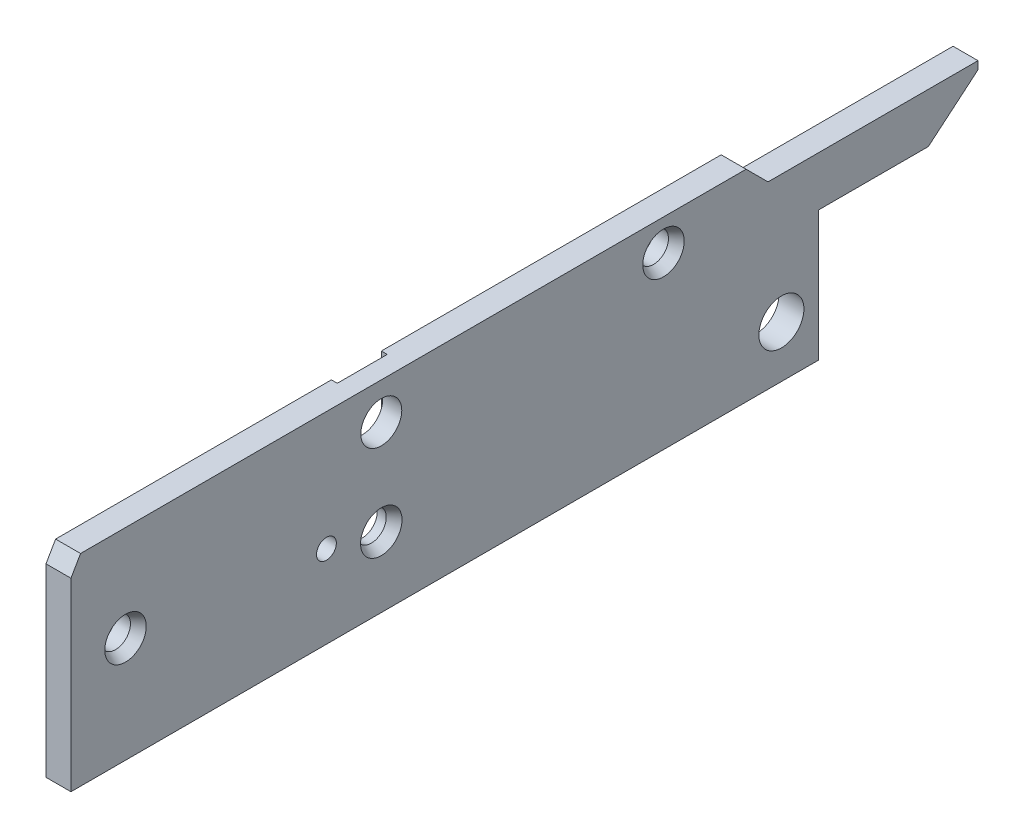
ISO-10303-21;
HEADER;
FILE_DESCRIPTION(('STEP AP214'),'2;1');
FILE_NAME('part.step','',(''),(''),'','','');
FILE_SCHEMA(('AUTOMOTIVE_DESIGN { 1 0 10303 214 1 1 1 1 }'));
ENDSEC;
DATA;
#1=APPLICATION_CONTEXT('core data for automotive mechanical design processes');
#2=APPLICATION_PROTOCOL_DEFINITION('international standard','automotive_design',2000,#1);
#3=PRODUCT_CONTEXT('',#1,'mechanical');
#4=PRODUCT('Part','Part','',(#3));
#5=PRODUCT_RELATED_PRODUCT_CATEGORY('part','',(#4));
#6=PRODUCT_DEFINITION_FORMATION('','',#4);
#7=PRODUCT_DEFINITION_CONTEXT('part definition',#1,'design');
#8=PRODUCT_DEFINITION('design','',#6,#7);
#9=PRODUCT_DEFINITION_SHAPE('','',#8);
#10=(LENGTH_UNIT() NAMED_UNIT(*) SI_UNIT(.MILLI.,.METRE.));
#11=(NAMED_UNIT(*) PLANE_ANGLE_UNIT() SI_UNIT($,.RADIAN.));
#12=(NAMED_UNIT(*) SI_UNIT($,.STERADIAN.) SOLID_ANGLE_UNIT());
#13=UNCERTAINTY_MEASURE_WITH_UNIT(LENGTH_MEASURE(1.E-05),#10,'distance_accuracy_value','');
#14=(GEOMETRIC_REPRESENTATION_CONTEXT(3) GLOBAL_UNCERTAINTY_ASSIGNED_CONTEXT((#13)) GLOBAL_UNIT_ASSIGNED_CONTEXT((#10,
#11,#12)) REPRESENTATION_CONTEXT('',''));
#15=CARTESIAN_POINT('',(0.,0.,0.));
#16=DIRECTION('',(0.,0.,1.));
#17=DIRECTION('',(1.,0.,0.));
#18=AXIS2_PLACEMENT_3D('',#15,#16,#17);
#19=CARTESIAN_POINT('',(0.,0.,0.));
#20=DIRECTION('',(-1.,0.,0.));
#21=DIRECTION('',(0.,0.,1.));
#22=AXIS2_PLACEMENT_3D('',#19,#20,#21);
#23=PLANE('',#22);
#24=CARTESIAN_POINT('',(0.,4.9276,72.2376));
#25=DIRECTION('',(-1.,0.,0.));
#26=DIRECTION('',(0.,0.,1.));
#27=AXIS2_PLACEMENT_3D('',#24,#25,#26);
#28=CIRCLE('',#27,2.2622076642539);
#29=CARTESIAN_POINT('',(0.,4.9276,74.4998076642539));
#30=VERTEX_POINT('',#29);
#31=EDGE_CURVE('E115',#30,#30,#28,.F.);
#32=ORIENTED_EDGE('',*,*,#31,.T.);
#33=EDGE_LOOP('',(#32));
#34=FACE_BOUND('',#33,.T.);
#35=CARTESIAN_POINT('',(0.,8.5852,104.14));
#36=DIRECTION('',(1.,0.,0.));
#37=DIRECTION('',(0.,0.,-1.));
#38=AXIS2_PLACEMENT_3D('',#35,#36,#37);
#39=CIRCLE('',#38,2.3749);
#40=CARTESIAN_POINT('',(0.,8.5852,101.7651));
#41=VERTEX_POINT('',#40);
#42=EDGE_CURVE('E379',#41,#41,#39,.T.);
#43=ORIENTED_EDGE('',*,*,#42,.T.);
#44=EDGE_LOOP('',(#43));
#45=FACE_BOUND('',#44,.T.);
#46=DIRECTION('',(0.,0.,1.));
#47=VECTOR('',#46,1.);
#48=CARTESIAN_POINT('',(0.,23.7998,5.60069999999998));
#49=LINE('',#48,#47);
#50=CARTESIAN_POINT('',(0.,23.7998,67.4878));
#51=VERTEX_POINT('',#50);
#52=CARTESIAN_POINT('',(0.,23.7998,111.2774));
#53=VERTEX_POINT('',#52);
#54=EDGE_CURVE('E243',#51,#53,#49,.T.);
#55=ORIENTED_EDGE('',*,*,#54,.F.);
#56=DIRECTION('',(0.,-1.,0.));
#57=VECTOR('',#56,1.);
#58=CARTESIAN_POINT('',(0.,23.7998,67.4878));
#59=LINE('',#58,#57);
#60=CARTESIAN_POINT('',(0.,-8.2042,67.4878));
#61=VERTEX_POINT('',#60);
#62=EDGE_CURVE('E458',#51,#61,#59,.T.);
#63=ORIENTED_EDGE('',*,*,#62,.T.);
#64=DIRECTION('',(0.,0.,-1.));
#65=VECTOR('',#64,1.);
#66=CARTESIAN_POINT('',(0.,-8.2042,112.8014));
#67=LINE('',#66,#65);
#68=CARTESIAN_POINT('',(0.,-8.2042,112.8014));
#69=VERTEX_POINT('',#68);
#70=EDGE_CURVE('E250',#69,#61,#67,.T.);
#71=ORIENTED_EDGE('',*,*,#70,.F.);
#72=DIRECTION('',(0.,-1.,0.));
#73=VECTOR('',#72,1.);
#74=CARTESIAN_POINT('',(0.,21.160154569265,112.8014));
#75=LINE('',#74,#73);
#76=CARTESIAN_POINT('',(0.,21.160154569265,112.8014));
#77=VERTEX_POINT('',#76);
#78=EDGE_CURVE('E248',#77,#69,#75,.T.);
#79=ORIENTED_EDGE('',*,*,#78,.F.);
#80=DIRECTION('',(0.,-0.866025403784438,0.500000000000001));
#81=VECTOR('',#80,1.);
#82=CARTESIAN_POINT('',(0.,23.7998,111.2774));
#83=LINE('',#82,#81);
#84=EDGE_CURVE('E216',#53,#77,#83,.T.);
#85=ORIENTED_EDGE('',*,*,#84,.F.);
#86=EDGE_LOOP('',(#55,#63,#71,#79,#85));
#87=FACE_BOUND('',#86,.T.);
#88=ADVANCED_FACE('F107',(#34,#45,#87),#23,.T.);
#89=CARTESIAN_POINT('',(0.,18.8468,18.7198));
#90=DIRECTION('',(1.,0.,0.));
#91=DIRECTION('',(0.,0.,-1.));
#92=AXIS2_PLACEMENT_3D('',#89,#90,#91);
#93=CIRCLE('',#92,2.3749);
#94=CARTESIAN_POINT('',(0.,18.8468,16.3449));
#95=VERTEX_POINT('',#94);
#96=EDGE_CURVE('E376',#95,#95,#93,.T.);
#97=ORIENTED_EDGE('',*,*,#96,.T.);
#98=EDGE_LOOP('',(#97));
#99=FACE_BOUND('',#98,.T.);
#100=CARTESIAN_POINT('',(0.,0.,0.));
#101=DIRECTION('',(1.,0.,0.));
#102=DIRECTION('',(0.,0.,-1.));
#103=AXIS2_PLACEMENT_3D('',#100,#101,#102);
#104=CIRCLE('',#103,3.57505);
#105=CARTESIAN_POINT('',(0.,0.,-3.57505));
#106=VERTEX_POINT('',#105);
#107=EDGE_CURVE('E393',#106,#106,#104,.T.);
#108=ORIENTED_EDGE('',*,*,#107,.T.);
#109=EDGE_LOOP('',(#108));
#110=FACE_BOUND('',#109,.T.);
#111=CARTESIAN_POINT('',(0.,-8.2042,59.563));
#112=VERTEX_POINT('',#111);
#113=CARTESIAN_POINT('',(0.,-8.2042,-5.91820000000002));
#114=VERTEX_POINT('',#113);
#115=EDGE_CURVE('E169',#112,#114,#67,.T.);
#116=ORIENTED_EDGE('',*,*,#115,.F.);
#117=DIRECTION('',(0.,1.,0.));
#118=VECTOR('',#117,1.);
#119=CARTESIAN_POINT('',(0.,23.7998,59.563));
#120=LINE('',#119,#118);
#121=CARTESIAN_POINT('',(0.,23.7998,59.563));
#122=VERTEX_POINT('',#121);
#123=EDGE_CURVE('E434',#112,#122,#120,.T.);
#124=ORIENTED_EDGE('',*,*,#123,.T.);
#125=CARTESIAN_POINT('',(0.,23.7998,5.60069999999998));
#126=VERTEX_POINT('',#125);
#127=EDGE_CURVE('E244',#126,#122,#49,.T.);
#128=ORIENTED_EDGE('',*,*,#127,.F.);
#129=DIRECTION('',(0.,0.707106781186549,0.707106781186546));
#130=VECTOR('',#129,1.);
#131=CARTESIAN_POINT('',(0.,20.32,2.12089999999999));
#132=LINE('',#131,#130);
#133=CARTESIAN_POINT('',(0.,20.32,2.12089999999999));
#134=VERTEX_POINT('',#133);
#135=EDGE_CURVE('E241',#134,#126,#132,.T.);
#136=ORIENTED_EDGE('',*,*,#135,.F.);
#137=DIRECTION('',(0.,0.,1.));
#138=VECTOR('',#137,1.);
#139=CARTESIAN_POINT('',(0.,20.32,-31.2166));
#140=LINE('',#139,#138);
#141=CARTESIAN_POINT('',(0.,20.32,-31.2166));
#142=VERTEX_POINT('',#141);
#143=EDGE_CURVE('E239',#142,#134,#140,.T.);
#144=ORIENTED_EDGE('',*,*,#143,.F.);
#145=DIRECTION('',(0.,1.,0.));
#146=VECTOR('',#145,1.);
#147=CARTESIAN_POINT('',(0.,19.065008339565,-31.2166));
#148=LINE('',#147,#146);
#149=CARTESIAN_POINT('',(0.,19.065008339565,-31.2166));
#150=VERTEX_POINT('',#149);
#151=EDGE_CURVE('E237',#150,#142,#148,.T.);
#152=ORIENTED_EDGE('',*,*,#151,.F.);
#153=DIRECTION('',(0.,0.642787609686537,-0.76604444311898));
#154=VECTOR('',#153,1.);
#155=CARTESIAN_POINT('',(0.,12.446,-23.3283730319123));
#156=LINE('',#155,#154);
#157=CARTESIAN_POINT('',(0.,12.446,-23.3283730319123));
#158=VERTEX_POINT('',#157);
#159=EDGE_CURVE('E235',#158,#150,#156,.T.);
#160=ORIENTED_EDGE('',*,*,#159,.F.);
#161=DIRECTION('',(0.,0.,-1.));
#162=VECTOR('',#161,1.);
#163=CARTESIAN_POINT('',(0.,12.446,-5.91820000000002));
#164=LINE('',#163,#162);
#165=CARTESIAN_POINT('',(0.,12.446,-5.91820000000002));
#166=VERTEX_POINT('',#165);
#167=EDGE_CURVE('E232',#166,#158,#164,.T.);
#168=ORIENTED_EDGE('',*,*,#167,.F.);
#169=DIRECTION('',(0.,1.,0.));
#170=VECTOR('',#169,1.);
#171=CARTESIAN_POINT('',(0.,-8.2042,-5.91820000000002));
#172=LINE('',#171,#170);
#173=EDGE_CURVE('E229',#114,#166,#172,.T.);
#174=ORIENTED_EDGE('',*,*,#173,.F.);
#175=EDGE_LOOP('',(#116,#124,#128,#136,#144,#152,#160,#168,#174));
#176=FACE_BOUND('',#175,.T.);
#177=ADVANCED_FACE('F311',(#99,#110,#176),#23,.T.);
#178=CARTESIAN_POINT('',(3.9624,23.7998,5.60069999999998));
#179=DIRECTION('',(0.,-1.,0.));
#180=DIRECTION('',(0.,0.,-1.));
#181=AXIS2_PLACEMENT_3D('',#178,#179,#180);
#182=PLANE('',#181);
#183=DIRECTION('',(-1.,0.,0.));
#184=VECTOR('',#183,1.);
#185=CARTESIAN_POINT('',(36.9329697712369,23.7998,67.4878));
#186=LINE('',#185,#184);
#187=CARTESIAN_POINT('',(0.939799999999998,23.7998,67.4878));
#188=VERTEX_POINT('',#187);
#189=EDGE_CURVE('E453',#188,#51,#186,.T.);
#190=ORIENTED_EDGE('',*,*,#189,.T.);
#191=ORIENTED_EDGE('',*,*,#54,.T.);
#192=DIRECTION('',(-1.,0.,0.));
#193=VECTOR('',#192,1.);
#194=CARTESIAN_POINT('',(3.9624,23.7998,111.2774));
#195=LINE('',#194,#193);
#196=CARTESIAN_POINT('',(3.9624,23.7998,111.2774));
#197=VERTEX_POINT('',#196);
#198=EDGE_CURVE('E219',#197,#53,#195,.T.);
#199=ORIENTED_EDGE('',*,*,#198,.F.);
#200=DIRECTION('',(0.,0.,1.));
#201=VECTOR('',#200,1.);
#202=CARTESIAN_POINT('',(3.9624,23.7998,5.60069999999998));
#203=LINE('',#202,#201);
#204=CARTESIAN_POINT('',(3.9624,23.7998,5.60069999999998));
#205=VERTEX_POINT('',#204);
#206=EDGE_CURVE('E207',#205,#197,#203,.T.);
#207=ORIENTED_EDGE('',*,*,#206,.F.);
#208=DIRECTION('',(-1.,0.,0.));
#209=VECTOR('',#208,1.);
#210=CARTESIAN_POINT('',(3.9624,23.7998,5.60069999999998));
#211=LINE('',#210,#209);
#212=EDGE_CURVE('E257',#205,#126,#211,.T.);
#213=ORIENTED_EDGE('',*,*,#212,.T.);
#214=ORIENTED_EDGE('',*,*,#127,.T.);
#215=DIRECTION('',(-1.,0.,0.));
#216=VECTOR('',#215,1.);
#217=CARTESIAN_POINT('',(36.9329697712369,23.7998,59.563));
#218=LINE('',#217,#216);
#219=CARTESIAN_POINT('',(0.939799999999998,23.7998,59.563));
#220=VERTEX_POINT('',#219);
#221=EDGE_CURVE('E439',#220,#122,#218,.T.);
#222=ORIENTED_EDGE('',*,*,#221,.F.);
#223=DIRECTION('',(0.,0.,-1.));
#224=VECTOR('',#223,1.);
#225=CARTESIAN_POINT('',(0.939799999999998,23.7998,59.563));
#226=LINE('',#225,#224);
#227=EDGE_CURVE('E462',#188,#220,#226,.T.);
#228=ORIENTED_EDGE('',*,*,#227,.F.);
#229=EDGE_LOOP('',(#190,#191,#199,#207,#213,#214,#222,#228));
#230=FACE_BOUND('',#229,.T.);
#231=ADVANCED_FACE('F316',(#230),#182,.F.);
#232=CARTESIAN_POINT('',(3.9624,-8.2042,112.8014));
#233=DIRECTION('',(0.,1.,0.));
#234=DIRECTION('',(0.,0.,1.));
#235=AXIS2_PLACEMENT_3D('',#232,#233,#234);
#236=PLANE('',#235);
#237=DIRECTION('',(-1.,0.,0.));
#238=VECTOR('',#237,1.);
#239=CARTESIAN_POINT('',(36.9329697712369,-8.2042,67.4878));
#240=LINE('',#239,#238);
#241=CARTESIAN_POINT('',(0.939800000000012,-8.2042,67.4878));
#242=VERTEX_POINT('',#241);
#243=EDGE_CURVE('E459',#242,#61,#240,.T.);
#244=ORIENTED_EDGE('',*,*,#243,.F.);
#245=DIRECTION('',(0.,0.,1.));
#246=VECTOR('',#245,1.);
#247=CARTESIAN_POINT('',(0.939799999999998,-8.2042,59.563));
#248=LINE('',#247,#246);
#249=CARTESIAN_POINT('',(0.9398,-8.2042,59.563));
#250=VERTEX_POINT('',#249);
#251=EDGE_CURVE('E382',#250,#242,#248,.T.);
#252=ORIENTED_EDGE('',*,*,#251,.F.);
#253=DIRECTION('',(-1.,0.,0.));
#254=VECTOR('',#253,1.);
#255=CARTESIAN_POINT('',(36.9329697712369,-8.2042,59.563));
#256=LINE('',#255,#254);
#257=EDGE_CURVE('E122',#250,#112,#256,.T.);
#258=ORIENTED_EDGE('',*,*,#257,.T.);
#259=ORIENTED_EDGE('',*,*,#115,.T.);
#260=DIRECTION('',(-1.,0.,0.));
#261=VECTOR('',#260,1.);
#262=CARTESIAN_POINT('',(3.9624,-8.2042,-5.91820000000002));
#263=LINE('',#262,#261);
#264=CARTESIAN_POINT('',(3.9624,-8.2042,-5.91820000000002));
#265=VERTEX_POINT('',#264);
#266=EDGE_CURVE('E225',#265,#114,#263,.T.);
#267=ORIENTED_EDGE('',*,*,#266,.F.);
#268=DIRECTION('',(0.,0.,-1.));
#269=VECTOR('',#268,1.);
#270=CARTESIAN_POINT('',(3.9624,-8.2042,112.8014));
#271=LINE('',#270,#269);
#272=CARTESIAN_POINT('',(3.9624,-8.2042,112.8014));
#273=VERTEX_POINT('',#272);
#274=EDGE_CURVE('E131',#273,#265,#271,.T.);
#275=ORIENTED_EDGE('',*,*,#274,.F.);
#276=DIRECTION('',(-1.,0.,0.));
#277=VECTOR('',#276,1.);
#278=CARTESIAN_POINT('',(3.9624,-8.2042,112.8014));
#279=LINE('',#278,#277);
#280=EDGE_CURVE('E220',#273,#69,#279,.T.);
#281=ORIENTED_EDGE('',*,*,#280,.T.);
#282=ORIENTED_EDGE('',*,*,#70,.T.);
#283=EDGE_LOOP('',(#244,#252,#258,#259,#267,#275,#281,#282));
#284=FACE_BOUND('',#283,.T.);
#285=ADVANCED_FACE('F321',(#284),#236,.F.);
#286=CARTESIAN_POINT('',(3.9624,2.921,63.5254));
#287=DIRECTION('',(-1.,0.,0.));
#288=DIRECTION('',(0.,0.,1.));
#289=AXIS2_PLACEMENT_3D('',#286,#287,#288);
#290=CYLINDRICAL_SURFACE('',#289,2.3749);
#291=CARTESIAN_POINT('',(2.37490000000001,2.921,63.5254));
#292=DIRECTION('',(-1.,0.,0.));
#293=DIRECTION('',(0.,0.,1.));
#294=AXIS2_PLACEMENT_3D('',#291,#292,#293);
#295=CIRCLE('',#294,2.3749);
#296=CARTESIAN_POINT('',(2.37490000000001,2.921,65.9003));
#297=VERTEX_POINT('',#296);
#298=EDGE_CURVE('E291',#297,#297,#295,.F.);
#299=ORIENTED_EDGE('',*,*,#298,.T.);
#300=EDGE_LOOP('',(#299));
#301=FACE_BOUND('',#300,.T.);
#302=CARTESIAN_POINT('',(0.9398,2.921,63.5254));
#303=DIRECTION('',(-1.,0.,0.));
#304=DIRECTION('',(0.,0.,1.));
#305=AXIS2_PLACEMENT_3D('',#302,#303,#304);
#306=CIRCLE('',#305,2.3749);
#307=CARTESIAN_POINT('',(0.9398,2.921,65.9003));
#308=VERTEX_POINT('',#307);
#309=EDGE_CURVE('E278',#308,#308,#306,.T.);
#310=ORIENTED_EDGE('',*,*,#309,.T.);
#311=EDGE_LOOP('',(#310));
#312=FACE_BOUND('',#311,.T.);
#313=ADVANCED_FACE('F324',(#301,#312),#290,.F.);
#314=CARTESIAN_POINT('',(3.9624,17.9832,63.5254));
#315=DIRECTION('',(-1.,0.,0.));
#316=DIRECTION('',(0.,0.,1.));
#317=AXIS2_PLACEMENT_3D('',#314,#315,#316);
#318=CYLINDRICAL_SURFACE('',#317,3.2512);
#319=CARTESIAN_POINT('',(3.9624,17.9832,63.5254));
#320=DIRECTION('',(1.,0.,0.));
#321=DIRECTION('',(0.,0.,-1.));
#322=AXIS2_PLACEMENT_3D('',#319,#320,#321);
#323=CIRCLE('',#322,3.2512);
#324=CARTESIAN_POINT('',(3.9624,17.9832,60.2742));
#325=VERTEX_POINT('',#324);
#326=EDGE_CURVE('E390',#325,#325,#323,.T.);
#327=ORIENTED_EDGE('',*,*,#326,.T.);
#328=EDGE_LOOP('',(#327));
#329=FACE_BOUND('',#328,.T.);
#330=CARTESIAN_POINT('',(0.9398,17.9832,63.5254));
#331=DIRECTION('',(-1.,0.,0.));
#332=DIRECTION('',(0.,0.,1.));
#333=AXIS2_PLACEMENT_3D('',#330,#331,#332);
#334=CIRCLE('',#333,3.2512);
#335=CARTESIAN_POINT('',(0.9398,17.9832,66.7766));
#336=VERTEX_POINT('',#335);
#337=EDGE_CURVE('E275',#336,#336,#334,.T.);
#338=ORIENTED_EDGE('',*,*,#337,.T.);
#339=EDGE_LOOP('',(#338));
#340=FACE_BOUND('',#339,.T.);
#341=ADVANCED_FACE('F371',(#329,#340),#318,.F.);
#342=CARTESIAN_POINT('',(3.9624,0.,0.));
#343=DIRECTION('',(-1.,0.,0.));
#344=DIRECTION('',(0.,0.,1.));
#345=AXIS2_PLACEMENT_3D('',#342,#343,#344);
#346=PLANE('',#345);
#347=CARTESIAN_POINT('',(3.9624,18.8468,18.7198));
#348=DIRECTION('',(-1.,0.,0.));
#349=DIRECTION('',(0.,0.,1.));
#350=AXIS2_PLACEMENT_3D('',#347,#348,#349);
#351=CIRCLE('',#350,3.29144355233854);
#352=CARTESIAN_POINT('',(3.9624,18.8468,22.0112435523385));
#353=VERTEX_POINT('',#352);
#354=EDGE_CURVE('E288',#353,#353,#351,.T.);
#355=ORIENTED_EDGE('',*,*,#354,.T.);
#356=EDGE_LOOP('',(#355));
#357=FACE_BOUND('',#356,.T.);
#358=CARTESIAN_POINT('',(3.9624,2.921,63.5254));
#359=DIRECTION('',(-1.,0.,0.));
#360=DIRECTION('',(0.,0.,1.));
#361=AXIS2_PLACEMENT_3D('',#358,#359,#360);
#362=CIRCLE('',#361,3.29144355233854);
#363=CARTESIAN_POINT('',(3.9624,2.921,66.8168435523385));
#364=VERTEX_POINT('',#363);
#365=EDGE_CURVE('E285',#364,#364,#362,.T.);
#366=ORIENTED_EDGE('',*,*,#365,.T.);
#367=EDGE_LOOP('',(#366));
#368=FACE_BOUND('',#367,.T.);
#369=CARTESIAN_POINT('',(3.9624,8.5852,104.14));
#370=DIRECTION('',(-1.,0.,0.));
#371=DIRECTION('',(0.,0.,1.));
#372=AXIS2_PLACEMENT_3D('',#369,#370,#371);
#373=CIRCLE('',#372,3.29144355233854);
#374=CARTESIAN_POINT('',(3.9624,8.5852,107.431443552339));
#375=VERTEX_POINT('',#374);
#376=EDGE_CURVE('E282',#375,#375,#373,.T.);
#377=ORIENTED_EDGE('',*,*,#376,.T.);
#378=EDGE_LOOP('',(#377));
#379=FACE_BOUND('',#378,.T.);
#380=ORIENTED_EDGE('',*,*,#326,.F.);
#381=EDGE_LOOP('',(#380));
#382=FACE_BOUND('',#381,.T.);
#383=CARTESIAN_POINT('',(3.9624,0.,0.));
#384=DIRECTION('',(1.,0.,0.));
#385=DIRECTION('',(0.,0.,-1.));
#386=AXIS2_PLACEMENT_3D('',#383,#384,#385);
#387=CIRCLE('',#386,3.57505);
#388=CARTESIAN_POINT('',(3.9624,0.,-3.57505));
#389=VERTEX_POINT('',#388);
#390=EDGE_CURVE('E233',#389,#389,#387,.T.);
#391=ORIENTED_EDGE('',*,*,#390,.F.);
#392=EDGE_LOOP('',(#391));
#393=FACE_BOUND('',#392,.T.);
#394=DIRECTION('',(0.,1.,0.));
#395=VECTOR('',#394,1.);
#396=CARTESIAN_POINT('',(3.9624,-8.2042,-5.91820000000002));
#397=LINE('',#396,#395);
#398=CARTESIAN_POINT('',(3.9624,12.446,-5.91820000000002));
#399=VERTEX_POINT('',#398);
#400=EDGE_CURVE('E253',#265,#399,#397,.T.);
#401=ORIENTED_EDGE('',*,*,#400,.T.);
#402=DIRECTION('',(0.,0.,-1.));
#403=VECTOR('',#402,1.);
#404=CARTESIAN_POINT('',(3.9624,12.446,-5.91820000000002));
#405=LINE('',#404,#403);
#406=CARTESIAN_POINT('',(3.9624,12.446,-23.3283730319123));
#407=VERTEX_POINT('',#406);
#408=EDGE_CURVE('E178',#399,#407,#405,.T.);
#409=ORIENTED_EDGE('',*,*,#408,.T.);
#410=DIRECTION('',(0.,0.642787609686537,-0.76604444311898));
#411=VECTOR('',#410,1.);
#412=CARTESIAN_POINT('',(3.9624,12.446,-23.3283730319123));
#413=LINE('',#412,#411);
#414=CARTESIAN_POINT('',(3.9624,19.065008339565,-31.2166));
#415=VERTEX_POINT('',#414);
#416=EDGE_CURVE('E400',#407,#415,#413,.T.);
#417=ORIENTED_EDGE('',*,*,#416,.T.);
#418=DIRECTION('',(0.,1.,0.));
#419=VECTOR('',#418,1.);
#420=CARTESIAN_POINT('',(3.9624,19.065008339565,-31.2166));
#421=LINE('',#420,#419);
#422=CARTESIAN_POINT('',(3.9624,20.32,-31.2166));
#423=VERTEX_POINT('',#422);
#424=EDGE_CURVE('E402',#415,#423,#421,.T.);
#425=ORIENTED_EDGE('',*,*,#424,.T.);
#426=DIRECTION('',(0.,0.,1.));
#427=VECTOR('',#426,1.);
#428=CARTESIAN_POINT('',(3.9624,20.32,-31.2166));
#429=LINE('',#428,#427);
#430=CARTESIAN_POINT('',(3.9624,20.32,2.12089999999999));
#431=VERTEX_POINT('',#430);
#432=EDGE_CURVE('E404',#423,#431,#429,.T.);
#433=ORIENTED_EDGE('',*,*,#432,.T.);
#434=DIRECTION('',(0.,0.707106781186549,0.707106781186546));
#435=VECTOR('',#434,1.);
#436=CARTESIAN_POINT('',(3.9624,20.32,2.12089999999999));
#437=LINE('',#436,#435);
#438=EDGE_CURVE('E406',#431,#205,#437,.T.);
#439=ORIENTED_EDGE('',*,*,#438,.T.);
#440=ORIENTED_EDGE('',*,*,#206,.T.);
#441=DIRECTION('',(0.,-0.866025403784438,0.500000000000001));
#442=VECTOR('',#441,1.);
#443=CARTESIAN_POINT('',(3.9624,23.7998,111.2774));
#444=LINE('',#443,#442);
#445=CARTESIAN_POINT('',(3.9624,21.160154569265,112.8014));
#446=VERTEX_POINT('',#445);
#447=EDGE_CURVE('E199',#197,#446,#444,.T.);
#448=ORIENTED_EDGE('',*,*,#447,.T.);
#449=DIRECTION('',(0.,-1.,0.));
#450=VECTOR('',#449,1.);
#451=CARTESIAN_POINT('',(3.9624,21.160154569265,112.8014));
#452=LINE('',#451,#450);
#453=EDGE_CURVE('E204',#446,#273,#452,.T.);
#454=ORIENTED_EDGE('',*,*,#453,.T.);
#455=ORIENTED_EDGE('',*,*,#274,.T.);
#456=EDGE_LOOP('',(#401,#409,#417,#425,#433,#439,#440,#448,#454,#455));
#457=FACE_BOUND('',#456,.T.);
#458=CARTESIAN_POINT('',(3.9624,4.9276,72.2376));
#459=DIRECTION('',(1.,0.,0.));
#460=DIRECTION('',(0.,0.,-1.));
#461=AXIS2_PLACEMENT_3D('',#458,#459,#460);
#462=CIRCLE('',#461,1.5748);
#463=CARTESIAN_POINT('',(3.9624,4.9276,70.6628));
#464=VERTEX_POINT('',#463);
#465=EDGE_CURVE('E387',#464,#464,#462,.T.);
#466=ORIENTED_EDGE('',*,*,#465,.F.);
#467=EDGE_LOOP('',(#466));
#468=FACE_BOUND('',#467,.T.);
#469=ADVANCED_FACE('F201',(#357,#368,#379,#382,#393,#457,#468),#346,.F.);
#470=CARTESIAN_POINT('',(3.9624,-8.2042,-5.91820000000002));
#471=DIRECTION('',(0.,0.,1.));
#472=DIRECTION('',(1.,0.,0.));
#473=AXIS2_PLACEMENT_3D('',#470,#471,#472);
#474=PLANE('',#473);
#475=ORIENTED_EDGE('',*,*,#173,.T.);
#476=DIRECTION('',(-1.,0.,0.));
#477=VECTOR('',#476,1.);
#478=CARTESIAN_POINT('',(3.9624,12.446,-5.91820000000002));
#479=LINE('',#478,#477);
#480=EDGE_CURVE('E272',#399,#166,#479,.T.);
#481=ORIENTED_EDGE('',*,*,#480,.F.);
#482=ORIENTED_EDGE('',*,*,#400,.F.);
#483=ORIENTED_EDGE('',*,*,#266,.T.);
#484=EDGE_LOOP('',(#475,#481,#482,#483));
#485=FACE_BOUND('',#484,.T.);
#486=ADVANCED_FACE('F352',(#485),#474,.F.);
#487=CARTESIAN_POINT('',(3.9624,12.446,-5.91820000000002));
#488=DIRECTION('',(0.,1.,0.));
#489=DIRECTION('',(0.,0.,1.));
#490=AXIS2_PLACEMENT_3D('',#487,#488,#489);
#491=PLANE('',#490);
#492=ORIENTED_EDGE('',*,*,#167,.T.);
#493=DIRECTION('',(-1.,0.,0.));
#494=VECTOR('',#493,1.);
#495=CARTESIAN_POINT('',(3.9624,12.446,-23.3283730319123));
#496=LINE('',#495,#494);
#497=EDGE_CURVE('E269',#407,#158,#496,.T.);
#498=ORIENTED_EDGE('',*,*,#497,.F.);
#499=ORIENTED_EDGE('',*,*,#408,.F.);
#500=ORIENTED_EDGE('',*,*,#480,.T.);
#501=EDGE_LOOP('',(#492,#498,#499,#500));
#502=FACE_BOUND('',#501,.T.);
#503=ADVANCED_FACE('F348',(#502),#491,.F.);
#504=CARTESIAN_POINT('',(3.9624,12.446,-23.3283730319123));
#505=DIRECTION('',(0.,0.766044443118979,0.642787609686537));
#506=DIRECTION('',(0.,-0.642787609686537,0.76604444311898));
#507=AXIS2_PLACEMENT_3D('',#504,#505,#506);
#508=PLANE('',#507);
#509=ORIENTED_EDGE('',*,*,#159,.T.);
#510=DIRECTION('',(-1.,0.,0.));
#511=VECTOR('',#510,1.);
#512=CARTESIAN_POINT('',(3.9624,19.065008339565,-31.2166));
#513=LINE('',#512,#511);
#514=EDGE_CURVE('E266',#415,#150,#513,.T.);
#515=ORIENTED_EDGE('',*,*,#514,.F.);
#516=ORIENTED_EDGE('',*,*,#416,.F.);
#517=ORIENTED_EDGE('',*,*,#497,.T.);
#518=EDGE_LOOP('',(#509,#515,#516,#517));
#519=FACE_BOUND('',#518,.T.);
#520=ADVANCED_FACE('F344',(#519),#508,.F.);
#521=CARTESIAN_POINT('',(3.9624,19.065008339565,-31.2166));
#522=DIRECTION('',(0.,0.,1.));
#523=DIRECTION('',(1.,0.,0.));
#524=AXIS2_PLACEMENT_3D('',#521,#522,#523);
#525=PLANE('',#524);
#526=ORIENTED_EDGE('',*,*,#151,.T.);
#527=DIRECTION('',(-1.,0.,0.));
#528=VECTOR('',#527,1.);
#529=CARTESIAN_POINT('',(3.9624,20.32,-31.2166));
#530=LINE('',#529,#528);
#531=EDGE_CURVE('E263',#423,#142,#530,.T.);
#532=ORIENTED_EDGE('',*,*,#531,.F.);
#533=ORIENTED_EDGE('',*,*,#424,.F.);
#534=ORIENTED_EDGE('',*,*,#514,.T.);
#535=EDGE_LOOP('',(#526,#532,#533,#534));
#536=FACE_BOUND('',#535,.T.);
#537=ADVANCED_FACE('F340',(#536),#525,.F.);
#538=CARTESIAN_POINT('',(3.9624,20.32,-31.2166));
#539=DIRECTION('',(0.,-1.,0.));
#540=DIRECTION('',(0.,0.,-1.));
#541=AXIS2_PLACEMENT_3D('',#538,#539,#540);
#542=PLANE('',#541);
#543=ORIENTED_EDGE('',*,*,#143,.T.);
#544=DIRECTION('',(-1.,0.,0.));
#545=VECTOR('',#544,1.);
#546=CARTESIAN_POINT('',(3.9624,20.32,2.12089999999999));
#547=LINE('',#546,#545);
#548=EDGE_CURVE('E260',#431,#134,#547,.T.);
#549=ORIENTED_EDGE('',*,*,#548,.F.);
#550=ORIENTED_EDGE('',*,*,#432,.F.);
#551=ORIENTED_EDGE('',*,*,#531,.T.);
#552=EDGE_LOOP('',(#543,#549,#550,#551));
#553=FACE_BOUND('',#552,.T.);
#554=ADVANCED_FACE('F336',(#553),#542,.F.);
#555=CARTESIAN_POINT('',(3.9624,20.32,2.12089999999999));
#556=DIRECTION('',(0.,-0.707106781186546,0.707106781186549));
#557=DIRECTION('',(0.,-0.707106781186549,-0.707106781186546));
#558=AXIS2_PLACEMENT_3D('',#555,#556,#557);
#559=PLANE('',#558);
#560=ORIENTED_EDGE('',*,*,#135,.T.);
#561=ORIENTED_EDGE('',*,*,#212,.F.);
#562=ORIENTED_EDGE('',*,*,#438,.F.);
#563=ORIENTED_EDGE('',*,*,#548,.T.);
#564=EDGE_LOOP('',(#560,#561,#562,#563));
#565=FACE_BOUND('',#564,.T.);
#566=ADVANCED_FACE('F330',(#565),#559,.F.);
#567=CARTESIAN_POINT('',(3.9624,23.7998,111.2774));
#568=DIRECTION('',(0.,-0.500000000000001,-0.866025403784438));
#569=DIRECTION('',(0.,0.866025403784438,-0.500000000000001));
#570=AXIS2_PLACEMENT_3D('',#567,#568,#569);
#571=PLANE('',#570);
#572=ORIENTED_EDGE('',*,*,#84,.T.);
#573=DIRECTION('',(-1.,0.,0.));
#574=VECTOR('',#573,1.);
#575=CARTESIAN_POINT('',(3.9624,21.160154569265,112.8014));
#576=LINE('',#575,#574);
#577=EDGE_CURVE('E213',#446,#77,#576,.T.);
#578=ORIENTED_EDGE('',*,*,#577,.F.);
#579=ORIENTED_EDGE('',*,*,#447,.F.);
#580=ORIENTED_EDGE('',*,*,#198,.T.);
#581=EDGE_LOOP('',(#572,#578,#579,#580));
#582=FACE_BOUND('',#581,.T.);
#583=ADVANCED_FACE('F214',(#582),#571,.F.);
#584=CARTESIAN_POINT('',(3.9624,21.160154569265,112.8014));
#585=DIRECTION('',(0.,0.,-1.));
#586=DIRECTION('',(-1.,0.,0.));
#587=AXIS2_PLACEMENT_3D('',#584,#585,#586);
#588=PLANE('',#587);
#589=ORIENTED_EDGE('',*,*,#78,.T.);
#590=ORIENTED_EDGE('',*,*,#280,.F.);
#591=ORIENTED_EDGE('',*,*,#453,.F.);
#592=ORIENTED_EDGE('',*,*,#577,.T.);
#593=EDGE_LOOP('',(#589,#590,#591,#592));
#594=FACE_BOUND('',#593,.T.);
#595=ADVANCED_FACE('F222',(#594),#588,.F.);
#596=CARTESIAN_POINT('',(3.9624,0.,0.));
#597=DIRECTION('',(-1.,0.,0.));
#598=DIRECTION('',(0.,0.,1.));
#599=AXIS2_PLACEMENT_3D('',#596,#597,#598);
#600=CYLINDRICAL_SURFACE('',#599,3.57505);
#601=ORIENTED_EDGE('',*,*,#390,.T.);
#602=EDGE_LOOP('',(#601));
#603=FACE_BOUND('',#602,.T.);
#604=ORIENTED_EDGE('',*,*,#107,.F.);
#605=EDGE_LOOP('',(#604));
#606=FACE_BOUND('',#605,.T.);
#607=ADVANCED_FACE('F327',(#603,#606),#600,.F.);
#608=CARTESIAN_POINT('',(3.9624,4.9276,72.2376));
#609=DIRECTION('',(-1.,0.,0.));
#610=DIRECTION('',(0.,0.,1.));
#611=AXIS2_PLACEMENT_3D('',#608,#609,#610);
#612=CYLINDRICAL_SURFACE('',#611,1.5748);
#613=CARTESIAN_POINT('',(1.190625,4.9276,72.2376));
#614=DIRECTION('',(-1.,0.,0.));
#615=DIRECTION('',(0.,0.,1.));
#616=AXIS2_PLACEMENT_3D('',#613,#614,#615);
#617=CIRCLE('',#616,1.5748);
#618=CARTESIAN_POINT('',(1.190625,4.9276,73.8124));
#619=VERTEX_POINT('',#618);
#620=EDGE_CURVE('E50',#619,#619,#617,.T.);
#621=ORIENTED_EDGE('',*,*,#620,.T.);
#622=EDGE_LOOP('',(#621));
#623=FACE_BOUND('',#622,.T.);
#624=ORIENTED_EDGE('',*,*,#465,.T.);
#625=EDGE_LOOP('',(#624));
#626=FACE_BOUND('',#625,.T.);
#627=ADVANCED_FACE('F489',(#623,#626),#612,.F.);
#628=CARTESIAN_POINT('',(3.9624,8.5852,104.14));
#629=DIRECTION('',(-1.,0.,0.));
#630=DIRECTION('',(0.,0.,1.));
#631=AXIS2_PLACEMENT_3D('',#628,#629,#630);
#632=CYLINDRICAL_SURFACE('',#631,2.3749);
#633=CARTESIAN_POINT('',(2.37490000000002,8.5852,104.14));
#634=DIRECTION('',(-1.,0.,0.));
#635=DIRECTION('',(0.,0.,1.));
#636=AXIS2_PLACEMENT_3D('',#633,#634,#635);
#637=CIRCLE('',#636,2.3749);
#638=CARTESIAN_POINT('',(2.37490000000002,8.5852,106.5149));
#639=VERTEX_POINT('',#638);
#640=EDGE_CURVE('E294',#639,#639,#637,.F.);
#641=ORIENTED_EDGE('',*,*,#640,.T.);
#642=EDGE_LOOP('',(#641));
#643=FACE_BOUND('',#642,.T.);
#644=ORIENTED_EDGE('',*,*,#42,.F.);
#645=EDGE_LOOP('',(#644));
#646=FACE_BOUND('',#645,.T.);
#647=ADVANCED_FACE('F485',(#643,#646),#632,.F.);
#648=CARTESIAN_POINT('',(3.9624,18.8468,18.7198));
#649=DIRECTION('',(-1.,0.,0.));
#650=DIRECTION('',(0.,0.,1.));
#651=AXIS2_PLACEMENT_3D('',#648,#649,#650);
#652=CYLINDRICAL_SURFACE('',#651,2.3749);
#653=CARTESIAN_POINT('',(2.37489999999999,18.8468,18.7198));
#654=DIRECTION('',(-1.,0.,0.));
#655=DIRECTION('',(0.,0.,1.));
#656=AXIS2_PLACEMENT_3D('',#653,#654,#655);
#657=CIRCLE('',#656,2.3749);
#658=CARTESIAN_POINT('',(2.37489999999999,18.8468,21.0947));
#659=VERTEX_POINT('',#658);
#660=EDGE_CURVE('E274',#659,#659,#657,.F.);
#661=ORIENTED_EDGE('',*,*,#660,.T.);
#662=EDGE_LOOP('',(#661));
#663=FACE_BOUND('',#662,.T.);
#664=ORIENTED_EDGE('',*,*,#96,.F.);
#665=EDGE_LOOP('',(#664));
#666=FACE_BOUND('',#665,.T.);
#667=ADVANCED_FACE('F481',(#663,#666),#652,.F.);
#668=CARTESIAN_POINT('',(36.9329697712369,23.7998,67.4878));
#669=DIRECTION('',(0.,0.,-1.));
#670=DIRECTION('',(0.,1.,0.));
#671=AXIS2_PLACEMENT_3D('',#668,#669,#670);
#672=PLANE('',#671);
#673=ORIENTED_EDGE('',*,*,#243,.T.);
#674=ORIENTED_EDGE('',*,*,#62,.F.);
#675=ORIENTED_EDGE('',*,*,#189,.F.);
#676=DIRECTION('',(0.,1.,0.));
#677=VECTOR('',#676,1.);
#678=CARTESIAN_POINT('',(0.939799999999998,23.7998,67.4878));
#679=LINE('',#678,#677);
#680=EDGE_CURVE('E456',#242,#188,#679,.T.);
#681=ORIENTED_EDGE('',*,*,#680,.F.);
#682=EDGE_LOOP('',(#673,#674,#675,#681));
#683=FACE_BOUND('',#682,.T.);
#684=ADVANCED_FACE('F455',(#683),#672,.T.);
#685=CARTESIAN_POINT('',(36.9329697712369,23.7998,59.563));
#686=DIRECTION('',(0.,0.,1.));
#687=DIRECTION('',(0.,-1.,0.));
#688=AXIS2_PLACEMENT_3D('',#685,#686,#687);
#689=PLANE('',#688);
#690=ORIENTED_EDGE('',*,*,#221,.T.);
#691=ORIENTED_EDGE('',*,*,#123,.F.);
#692=ORIENTED_EDGE('',*,*,#257,.F.);
#693=DIRECTION('',(0.,-1.,0.));
#694=VECTOR('',#693,1.);
#695=CARTESIAN_POINT('',(0.939799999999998,23.7998,59.563));
#696=LINE('',#695,#694);
#697=EDGE_CURVE('E279',#220,#250,#696,.T.);
#698=ORIENTED_EDGE('',*,*,#697,.F.);
#699=EDGE_LOOP('',(#690,#691,#692,#698));
#700=FACE_BOUND('',#699,.T.);
#701=ADVANCED_FACE('F472',(#700),#689,.T.);
#702=CARTESIAN_POINT('',(0.9398,0.,0.));
#703=DIRECTION('',(-1.,0.,0.));
#704=DIRECTION('',(0.,0.,1.));
#705=AXIS2_PLACEMENT_3D('',#702,#703,#704);
#706=PLANE('',#705);
#707=ORIENTED_EDGE('',*,*,#309,.F.);
#708=EDGE_LOOP('',(#707));
#709=FACE_BOUND('',#708,.T.);
#710=ORIENTED_EDGE('',*,*,#337,.F.);
#711=EDGE_LOOP('',(#710));
#712=FACE_BOUND('',#711,.T.);
#713=ORIENTED_EDGE('',*,*,#227,.T.);
#714=ORIENTED_EDGE('',*,*,#697,.T.);
#715=ORIENTED_EDGE('',*,*,#251,.T.);
#716=ORIENTED_EDGE('',*,*,#680,.T.);
#717=EDGE_LOOP('',(#713,#714,#715,#716));
#718=FACE_BOUND('',#717,.T.);
#719=ADVANCED_FACE('F359',(#709,#712,#718),#706,.T.);
#720=CARTESIAN_POINT('',(2.37489999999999,18.8468,18.7198));
#721=DIRECTION('',(1.,0.,0.));
#722=DIRECTION('',(0.,0.,-1.));
#723=AXIS2_PLACEMENT_3D('',#720,#721,#722);
#724=CONICAL_SURFACE('',#723,2.3749,0.523598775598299);
#725=ORIENTED_EDGE('',*,*,#354,.F.);
#726=EDGE_LOOP('',(#725));
#727=FACE_BOUND('',#726,.T.);
#728=ORIENTED_EDGE('',*,*,#660,.F.);
#729=EDGE_LOOP('',(#728));
#730=FACE_BOUND('',#729,.T.);
#731=ADVANCED_FACE('F356',(#727,#730),#724,.F.);
#732=CARTESIAN_POINT('',(2.37490000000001,2.921,63.5254));
#733=DIRECTION('',(1.,0.,0.));
#734=DIRECTION('',(0.,0.,-1.));
#735=AXIS2_PLACEMENT_3D('',#732,#733,#734);
#736=CONICAL_SURFACE('',#735,2.3749,0.523598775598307);
#737=ORIENTED_EDGE('',*,*,#365,.F.);
#738=EDGE_LOOP('',(#737));
#739=FACE_BOUND('',#738,.T.);
#740=ORIENTED_EDGE('',*,*,#298,.F.);
#741=EDGE_LOOP('',(#740));
#742=FACE_BOUND('',#741,.T.);
#743=ADVANCED_FACE('F307',(#739,#742),#736,.F.);
#744=CARTESIAN_POINT('',(2.37490000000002,8.5852,104.14));
#745=DIRECTION('',(1.,0.,0.));
#746=DIRECTION('',(0.,0.,-1.));
#747=AXIS2_PLACEMENT_3D('',#744,#745,#746);
#748=CONICAL_SURFACE('',#747,2.3749,0.523598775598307);
#749=ORIENTED_EDGE('',*,*,#376,.F.);
#750=EDGE_LOOP('',(#749));
#751=FACE_BOUND('',#750,.T.);
#752=ORIENTED_EDGE('',*,*,#640,.F.);
#753=EDGE_LOOP('',(#752));
#754=FACE_BOUND('',#753,.T.);
#755=ADVANCED_FACE('F302',(#751,#754),#748,.F.);
#756=CARTESIAN_POINT('',(0.,4.9276,72.2376));
#757=DIRECTION('',(-1.,0.,0.));
#758=DIRECTION('',(0.,0.,1.));
#759=AXIS2_PLACEMENT_3D('',#756,#757,#758);
#760=CONICAL_SURFACE('',#759,2.2622076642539,0.523598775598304);
#761=ORIENTED_EDGE('',*,*,#620,.F.);
#762=EDGE_LOOP('',(#761));
#763=FACE_BOUND('',#762,.T.);
#764=ORIENTED_EDGE('',*,*,#31,.F.);
#765=EDGE_LOOP('',(#764));
#766=FACE_BOUND('',#765,.T.);
#767=ADVANCED_FACE('F109',(#763,#766),#760,.F.);
#768=CLOSED_SHELL('',(#88,#177,#231,#285,#313,#341,#469,#486,#503,#520,#537,#554,#566,#583,#595,
#607,#627,#647,#667,#684,#701,#719,#731,#743,#755,#767));
#769=MANIFOLD_SOLID_BREP('B6',#768);
#770=ADVANCED_BREP_SHAPE_REPRESENTATION('',(#18,#769),#14);
#771=SHAPE_DEFINITION_REPRESENTATION(#9,#770);
ENDSEC;
END-ISO-10303-21;
